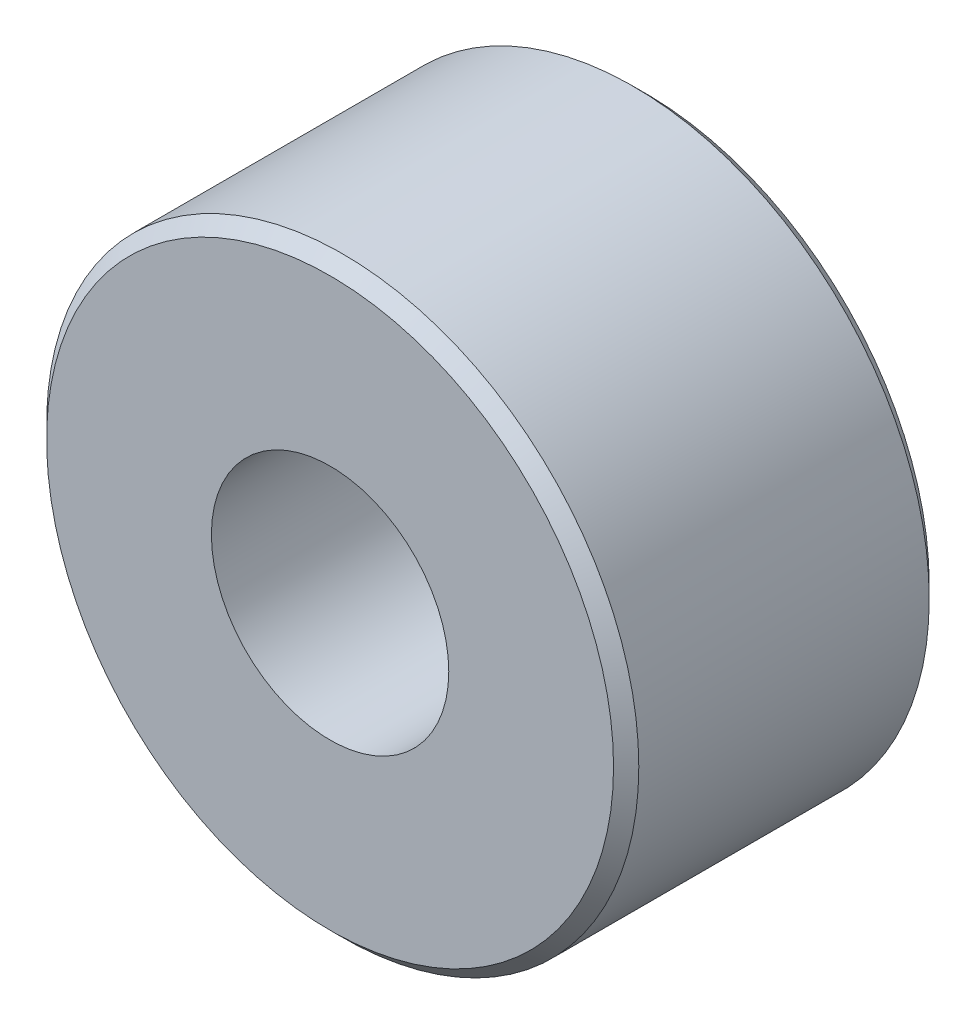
ISO-10303-21;
HEADER;
FILE_DESCRIPTION(('STEP AP214'),'2;1');
FILE_NAME('part.step','',(''),(''),'','','');
FILE_SCHEMA(('AUTOMOTIVE_DESIGN { 1 0 10303 214 1 1 1 1 }'));
ENDSEC;
DATA;
#1=APPLICATION_CONTEXT('core data for automotive mechanical design processes');
#2=APPLICATION_PROTOCOL_DEFINITION('international standard','automotive_design',2000,#1);
#3=PRODUCT_CONTEXT('',#1,'mechanical');
#4=PRODUCT('Part','Part','',(#3));
#5=PRODUCT_RELATED_PRODUCT_CATEGORY('part','',(#4));
#6=PRODUCT_DEFINITION_FORMATION('','',#4);
#7=PRODUCT_DEFINITION_CONTEXT('part definition',#1,'design');
#8=PRODUCT_DEFINITION('design','',#6,#7);
#9=PRODUCT_DEFINITION_SHAPE('','',#8);
#10=(LENGTH_UNIT() NAMED_UNIT(*) SI_UNIT(.MILLI.,.METRE.));
#11=(NAMED_UNIT(*) PLANE_ANGLE_UNIT() SI_UNIT($,.RADIAN.));
#12=(NAMED_UNIT(*) SI_UNIT($,.STERADIAN.) SOLID_ANGLE_UNIT());
#13=UNCERTAINTY_MEASURE_WITH_UNIT(LENGTH_MEASURE(1.E-05),#10,'distance_accuracy_value','');
#14=(GEOMETRIC_REPRESENTATION_CONTEXT(3) GLOBAL_UNCERTAINTY_ASSIGNED_CONTEXT((#13)) GLOBAL_UNIT_ASSIGNED_CONTEXT((#10,
#11,#12)) REPRESENTATION_CONTEXT('',''));
#15=CARTESIAN_POINT('',(0.,0.,0.));
#16=DIRECTION('',(0.,0.,1.));
#17=DIRECTION('',(1.,0.,0.));
#18=AXIS2_PLACEMENT_3D('',#15,#16,#17);
#19=CARTESIAN_POINT('',(0.,0.,3.175));
#20=DIRECTION('',(0.,0.,-1.));
#21=DIRECTION('',(-1.,0.,0.));
#22=AXIS2_PLACEMENT_3D('',#19,#20,#21);
#23=CYLINDRICAL_SURFACE('',#22,5.9563);
#24=CARTESIAN_POINT('',(0.,0.,-2.921));
#25=DIRECTION('',(0.,0.,1.));
#26=DIRECTION('',(1.,0.,0.));
#27=AXIS2_PLACEMENT_3D('',#24,#25,#26);
#28=CIRCLE('',#27,5.9563);
#29=CARTESIAN_POINT('',(5.9563,0.,-2.921));
#30=VERTEX_POINT('',#29);
#31=EDGE_CURVE('E42',#30,#30,#28,.T.);
#32=ORIENTED_EDGE('',*,*,#31,.T.);
#33=EDGE_LOOP('',(#32));
#34=FACE_BOUND('',#33,.T.);
#35=CARTESIAN_POINT('',(0.,0.,2.921));
#36=DIRECTION('',(0.,0.,1.));
#37=DIRECTION('',(1.,0.,0.));
#38=AXIS2_PLACEMENT_3D('',#35,#36,#37);
#39=CIRCLE('',#38,5.9563);
#40=CARTESIAN_POINT('',(5.9563,0.,2.921));
#41=VERTEX_POINT('',#40);
#42=EDGE_CURVE('E46',#41,#41,#39,.F.);
#43=ORIENTED_EDGE('',*,*,#42,.T.);
#44=EDGE_LOOP('',(#43));
#45=FACE_BOUND('',#44,.T.);
#46=ADVANCED_FACE('F31',(#34,#45),#23,.T.);
#47=CARTESIAN_POINT('',(0.,0.,3.175));
#48=DIRECTION('',(0.,0.,1.));
#49=DIRECTION('',(1.,0.,0.));
#50=AXIS2_PLACEMENT_3D('',#47,#48,#49);
#51=PLANE('',#50);
#52=CARTESIAN_POINT('',(0.,0.,3.175));
#53=DIRECTION('',(0.,0.,1.));
#54=DIRECTION('',(1.,0.,0.));
#55=AXIS2_PLACEMENT_3D('',#52,#53,#54);
#56=CIRCLE('',#55,5.7023);
#57=CARTESIAN_POINT('',(5.7023,0.,3.175));
#58=VERTEX_POINT('',#57);
#59=EDGE_CURVE('E10',#58,#58,#56,.T.);
#60=ORIENTED_EDGE('',*,*,#59,.T.);
#61=EDGE_LOOP('',(#60));
#62=FACE_BOUND('',#61,.T.);
#63=CARTESIAN_POINT('',(0.,0.,3.175));
#64=DIRECTION('',(0.,0.,1.));
#65=DIRECTION('',(1.,0.,0.));
#66=AXIS2_PLACEMENT_3D('',#63,#64,#65);
#67=CIRCLE('',#66,2.3876);
#68=CARTESIAN_POINT('',(2.3876,0.,3.175));
#69=VERTEX_POINT('',#68);
#70=EDGE_CURVE('E52',#69,#69,#67,.T.);
#71=ORIENTED_EDGE('',*,*,#70,.F.);
#72=EDGE_LOOP('',(#71));
#73=FACE_BOUND('',#72,.T.);
#74=ADVANCED_FACE('F67',(#62,#73),#51,.T.);
#75=CARTESIAN_POINT('',(0.,0.,-3.175));
#76=DIRECTION('',(0.,0.,1.));
#77=DIRECTION('',(1.,0.,0.));
#78=AXIS2_PLACEMENT_3D('',#75,#76,#77);
#79=PLANE('',#78);
#80=CARTESIAN_POINT('',(0.,0.,-3.175));
#81=DIRECTION('',(0.,0.,1.));
#82=DIRECTION('',(1.,0.,0.));
#83=AXIS2_PLACEMENT_3D('',#80,#81,#82);
#84=CIRCLE('',#83,5.70229999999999);
#85=CARTESIAN_POINT('',(5.70229999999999,0.,-3.175));
#86=VERTEX_POINT('',#85);
#87=EDGE_CURVE('E38',#86,#86,#84,.F.);
#88=ORIENTED_EDGE('',*,*,#87,.T.);
#89=EDGE_LOOP('',(#88));
#90=FACE_BOUND('',#89,.T.);
#91=CARTESIAN_POINT('',(0.,0.,-3.175));
#92=DIRECTION('',(0.,0.,1.));
#93=DIRECTION('',(1.,0.,0.));
#94=AXIS2_PLACEMENT_3D('',#91,#92,#93);
#95=CIRCLE('',#94,2.3876);
#96=CARTESIAN_POINT('',(2.3876,0.,-3.175));
#97=VERTEX_POINT('',#96);
#98=EDGE_CURVE('E51',#97,#97,#95,.T.);
#99=ORIENTED_EDGE('',*,*,#98,.T.);
#100=EDGE_LOOP('',(#99));
#101=FACE_BOUND('',#100,.T.);
#102=ADVANCED_FACE('F58',(#90,#101),#79,.F.);
#103=CARTESIAN_POINT('',(0.,0.,-3.175));
#104=DIRECTION('',(0.,0.,1.));
#105=DIRECTION('',(1.,0.,0.));
#106=AXIS2_PLACEMENT_3D('',#103,#104,#105);
#107=CYLINDRICAL_SURFACE('',#106,2.3876);
#108=ORIENTED_EDGE('',*,*,#98,.F.);
#109=EDGE_LOOP('',(#108));
#110=FACE_BOUND('',#109,.T.);
#111=ORIENTED_EDGE('',*,*,#70,.T.);
#112=EDGE_LOOP('',(#111));
#113=FACE_BOUND('',#112,.T.);
#114=ADVANCED_FACE('F60',(#110,#113),#107,.F.);
#115=CARTESIAN_POINT('',(0.,0.,-2.921));
#116=DIRECTION('',(0.,0.,1.));
#117=DIRECTION('',(1.,0.,0.));
#118=AXIS2_PLACEMENT_3D('',#115,#116,#117);
#119=CONICAL_SURFACE('',#118,5.9563,0.785398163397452);
#120=ORIENTED_EDGE('',*,*,#87,.F.);
#121=EDGE_LOOP('',(#120));
#122=FACE_BOUND('',#121,.T.);
#123=ORIENTED_EDGE('',*,*,#31,.F.);
#124=EDGE_LOOP('',(#123));
#125=FACE_BOUND('',#124,.T.);
#126=ADVANCED_FACE('F63',(#122,#125),#119,.T.);
#127=CARTESIAN_POINT('',(0.,0.,3.175));
#128=DIRECTION('',(0.,0.,-1.));
#129=DIRECTION('',(-1.,0.,0.));
#130=AXIS2_PLACEMENT_3D('',#127,#128,#129);
#131=CONICAL_SURFACE('',#130,5.7023,0.785398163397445);
#132=ORIENTED_EDGE('',*,*,#42,.F.);
#133=EDGE_LOOP('',(#132));
#134=FACE_BOUND('',#133,.T.);
#135=ORIENTED_EDGE('',*,*,#59,.F.);
#136=EDGE_LOOP('',(#135));
#137=FACE_BOUND('',#136,.T.);
#138=ADVANCED_FACE('F33',(#134,#137),#131,.T.);
#139=CLOSED_SHELL('',(#46,#74,#102,#114,#126,#138));
#140=MANIFOLD_SOLID_BREP('B2',#139);
#141=ADVANCED_BREP_SHAPE_REPRESENTATION('',(#18,#140),#14);
#142=SHAPE_DEFINITION_REPRESENTATION(#9,#141);
ENDSEC;
END-ISO-10303-21;
